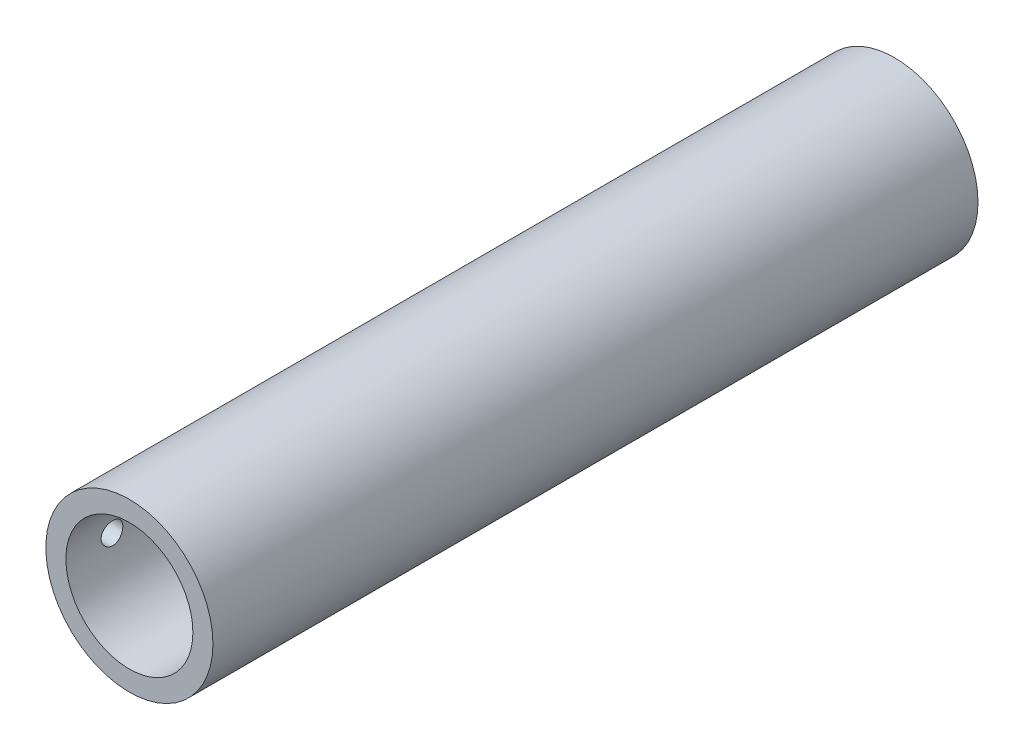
from build123d import *

# Parameters (mm, degrees)
SKETCH1_R           = 12.7
SKETCH1_R_2         = 9.652
BOSS_EXTRUDE1_DEPTH = 116.3
SKETCH2_R           = 1.65
CUT_EXTRUDE1_DEPTH  = 30


with BuildPart() as part:
    # Sketch1 → Boss-Extrude1 (new body)
    with BuildSketch(Plane.XY):
        Circle(SKETCH1_R)
        Circle(SKETCH1_R_2, mode=Mode.SUBTRACT)
    extrude(amount=BOSS_EXTRUDE1_DEPTH)

    # Sketch2 → Cut-Extrude1 (cut)
    with BuildSketch(Plane(origin=(0, 0, 0), x_dir=(0, 0, -1), z_dir=(1, 0, 0))):
        with Locations(Location((-109.3, 0, 0), (0, 0, 180))):
            Circle(SKETCH2_R)
        with Locations(Location((-29.8, 0, 0), (0, 0, 180))):
            Circle(SKETCH2_R)
        with Locations(Location((-18, 0, 0), (0, 0, 180))):
            Circle(SKETCH2_R)
    extrude(amount=-CUT_EXTRUDE1_DEPTH, mode=Mode.SUBTRACT)


solid = part.part
